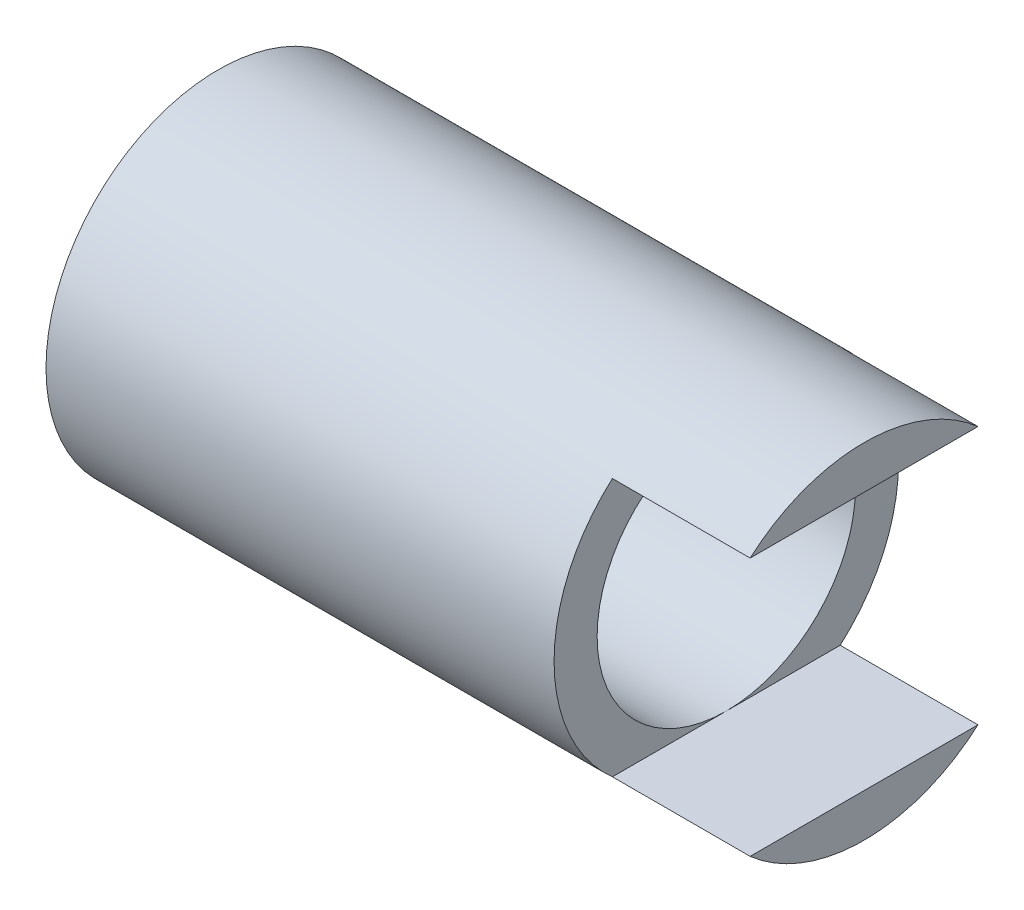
from build123d import *

# Parameters (mm, degrees)
SKETCH1_W          = 15
SKETCH1_H          = 1
SKETCH2_W          = 10
SKETCH2_H          = 6
CUT_EXTRUDE1_DEPTH = 3.2
CUT_EXTRUDE2_DEPTH = 17.031219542


with BuildPart() as part:
    # Sketch1 → Revolve1 (revolve)
    with BuildSketch(Plane.XY, mode=Mode.PRIVATE) as revolve1_sk:
        with Locations((7.5, 3.5)):
            Rectangle(SKETCH1_W, SKETCH1_H)
    revolve(revolve1_sk.sketch.rotate(Axis((-6.900875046, 0, 0), (1, 0, 0)), 90), axis=Axis((-6.900875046, 0, 0), (1, 0, 0)))

    # Sketch2 → Cut-Extrude1 (cut)
    with BuildSketch(Plane(origin=(15, 0, 0), x_dir=(0, 0, -1), z_dir=(1, 0, 0))):
        Rectangle(SKETCH2_W, SKETCH2_H)
    extrude(amount=-CUT_EXTRUDE1_DEPTH, mode=Mode.SUBTRACT)

    # Sketch3 → Cut-Extrude2 (cut, through all)
    with BuildSketch(Plane.XY):
        with BuildLine():
            Line((0, 1), (6.5, 1))
            ThreePointArc((6.5, 1), (7.5, 0), (6.5, -1))
            Line((6.5, -1), (0, -1))
            Line((0, -1), (0, 1))
        make_face()
    extrude(amount=-CUT_EXTRUDE2_DEPTH, mode=Mode.SUBTRACT)


solid = part.part
